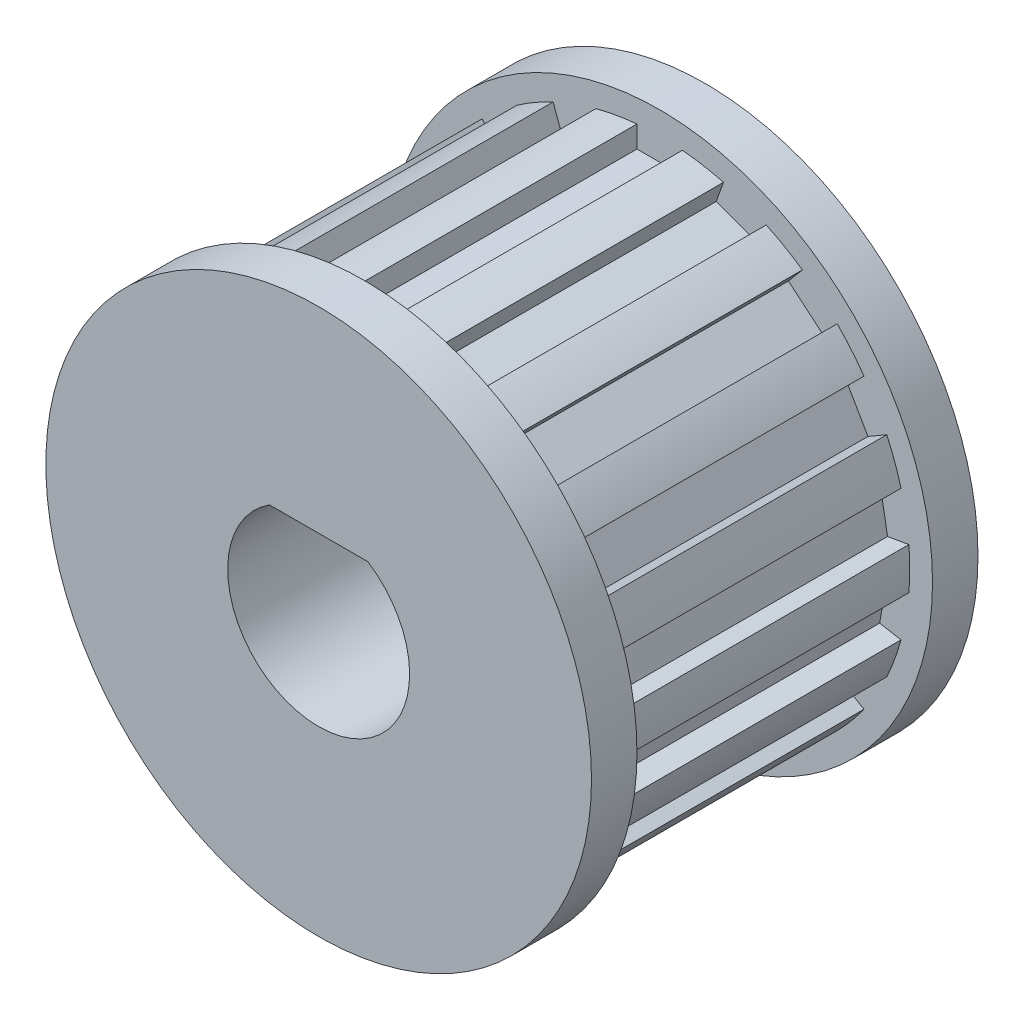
from build123d import *

# Parameters (mm, degrees)
ESQUISSE1_R                  = 6
BASE_EXTRUSION_DEPTH         = 1
ESQUISSE2_R                  = 5.5
BOSS_EXTRU_1_DEPTH           = 6.5
ESQUISSE4_R                  = 6
BOSS_EXTRU_2_DEPTH           = 1
ENL_V_MAT_EXTRU_1_DEPTH      = 5
ENL_V_START                  = -3.5
ESQUISSE6_R                  = 2
ENL_V_MAT_EXTRU_2_DEPTH      = 3.5
ESQUISSE9_W                  = 1
ESQUISSE9_H                  = 8
ENL_V_MAT_EXTRU_3_DEPTH      = 6.5
R_P_TITION_CIRCULAIRE1_COUNT = 18


with BuildPart() as part:
    # Esquisse1 → Base-Extrusion (new body)
    with BuildSketch(Plane.XY):
        Circle(ESQUISSE1_R)
    extrude(amount=BASE_EXTRUSION_DEPTH)

    # Esquisse2 → Boss.-Extru.1 (add)
    with BuildSketch(Plane.XY.offset(1)):
        Circle(ESQUISSE2_R)
    extrude(amount=BOSS_EXTRU_1_DEPTH)

    # Esquisse4 → Boss.-Extru.2 (add)
    with BuildSketch(Plane.XY.offset(7.5)):
        Circle(ESQUISSE4_R)
    extrude(amount=BOSS_EXTRU_2_DEPTH)

    # Esquisse5 → Enl_v. mat.-Extru.1 (cut)
    with BuildSketch(Plane.XY.offset(8.5)):
        with BuildLine():
            Line((-1.081515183, 1.682356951), (1.081515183, 1.682356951))
            ThreePointArc((1.081515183, 1.682356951), (0, -2), (-1.081515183, 1.682356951))
        make_face()
    extrude(amount=-ENL_V_MAT_EXTRU_1_DEPTH, mode=Mode.SUBTRACT)

    # Esquisse6 → Enl_v. mat.-Extru.2 (cut)
    with BuildSketch(Plane(origin=(0, 0, 0), x_dir=(-1, 0, 0), z_dir=(0, 0, -1)).offset(ENL_V_START)):
        with Locations(Location((0, 0, 0), (0, 0, 122.735226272))):
            Circle(ESQUISSE6_R)
    extrude(amount=ENL_V_MAT_EXTRU_2_DEPTH, mode=Mode.SUBTRACT)

    # Esquisse9 → Enl_v. mat.-Extru.3 (cut)
    with BuildSketch(Plane.XY.offset(1)):
        with Locations((0, 9)):
            Rectangle(ESQUISSE9_W, ESQUISSE9_H)
    enl_v_mat_extru_3 = extrude(amount=ENL_V_MAT_EXTRU_3_DEPTH, mode=Mode.SUBTRACT)

    # R_p_tition circulaire1: Enl_v. mat.-Extru.3 ×18 about axis
    r_p_tition_circulaire1_axis = Axis((0, 0, 0), (0, 0, -1))
    for i in range(1, R_P_TITION_CIRCULAIRE1_COUNT):
        add(enl_v_mat_extru_3.rotate(r_p_tition_circulaire1_axis, i * 360 / R_P_TITION_CIRCULAIRE1_COUNT), mode=Mode.SUBTRACT)


solid = part.part
